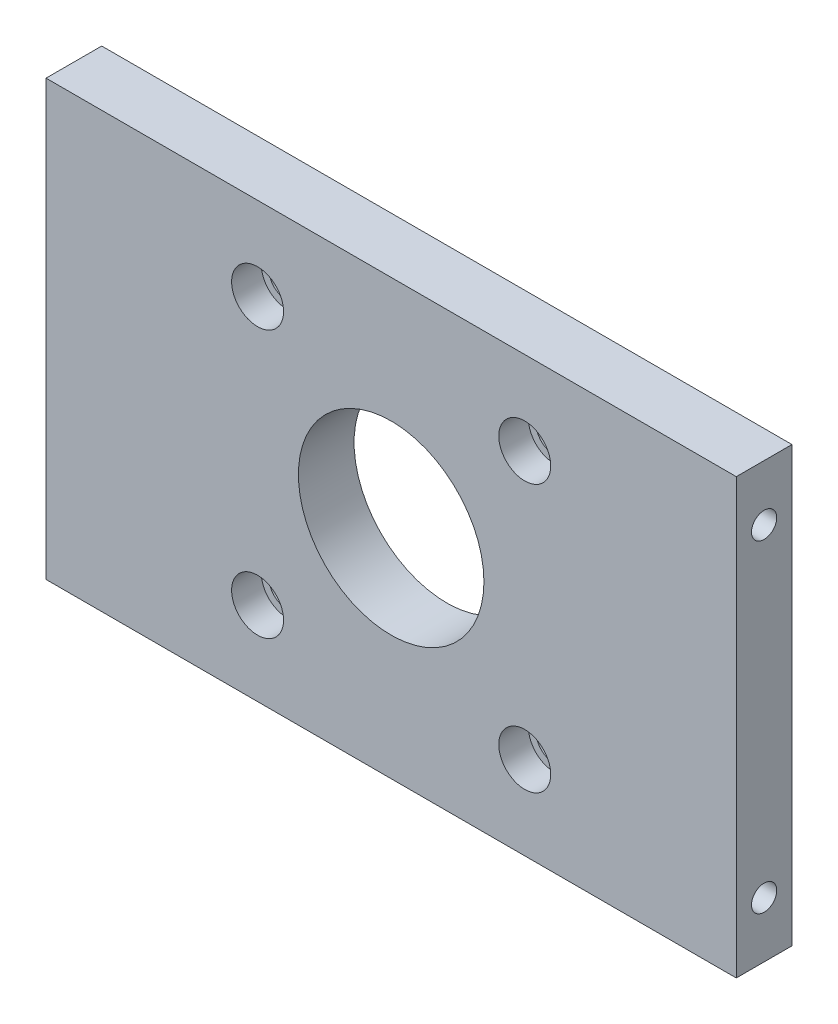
from build123d import *

# Parameters (mm, degrees)
ESQUISSE1_W                                     = 186
ESQUISSE1_H                                     = 117
BASE_EXTRUSION_DEPTH                            = 15
ESQUISSE2_R                                     = 25
ENL_V_MAT_EXTRU_1_DEPTH                         = 15
CHAMBRAGE_POUR_VIS_T_TE_CYLINDRIQUE_D           = 10
CHAMBRAGE_POUR_VIS_T_TE_CYLINDRIQUE_DEPTH       = 45
CHAMBRAGE_POUR_VIS_T_TE_CYLINDRIQUE_CBORE_D     = 14
CHAMBRAGE_POUR_VIS_T_TE_CYLINDRIQUE_CBORE_DEPTH = 8
CHAMBRAGE_POUR_VIS_T_TE_CYLINDRIQUE_TIP         = 3.004303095
TROU_TARAUD_M8X1_251_D                          = 6.8
TROU_TARAUD_M8X1_251_DEPTH                      = 46.25
TROU_TARAUD_M8X1_251_TIP                        = 2.042926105
TROU_TARAUD_M8X1_252_D                          = 6.8
TROU_TARAUD_M8X1_252_DEPTH                      = 46.25
TROU_TARAUD_M8X1_252_TIP                        = 2.042926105


with BuildPart() as part:
    # Esquisse1 → Base-Extrusion (new body)
    with BuildSketch(Plane.XY):
        with Locations((23.026869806, 5.193490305)):
            Rectangle(ESQUISSE1_W, ESQUISSE1_H)
    extrude(amount=BASE_EXTRUSION_DEPTH)

    # Esquisse2 → Enl_v. mat.-Extru.1 (cut)
    with BuildSketch(Plane.XY.offset(15)):
        with Locations((23.026869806, 5.193490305)):
            Circle(ESQUISSE2_R)
    extrude(amount=-ENL_V_MAT_EXTRU_1_DEPTH, mode=Mode.SUBTRACT)

    # Chambrage pour vis _ t_te cylindrique
    with Locations(Plane.XY.offset(15)):
        with Locations((-12.973130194, 41.193490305), (-12.973130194, -30.806509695), (59.026869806, -30.806509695), (59.026869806, 41.193490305)):
            CounterBoreHole(CHAMBRAGE_POUR_VIS_T_TE_CYLINDRIQUE_D / 2, CHAMBRAGE_POUR_VIS_T_TE_CYLINDRIQUE_CBORE_D / 2, CHAMBRAGE_POUR_VIS_T_TE_CYLINDRIQUE_CBORE_DEPTH, depth=CHAMBRAGE_POUR_VIS_T_TE_CYLINDRIQUE_DEPTH)
            with Locations((0, 0, -(CHAMBRAGE_POUR_VIS_T_TE_CYLINDRIQUE_DEPTH + CHAMBRAGE_POUR_VIS_T_TE_CYLINDRIQUE_TIP / 2))):  # 118° drill point
                Cone(0, CHAMBRAGE_POUR_VIS_T_TE_CYLINDRIQUE_D / 2, CHAMBRAGE_POUR_VIS_T_TE_CYLINDRIQUE_TIP, mode=Mode.SUBTRACT)

    # Trou taraud_ M8x1.251
    with Locations(Plane.ZY.offset(69.973130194)):
        with Locations((7.5, 48.693490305), (7.5, -38.306509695)):
            Hole(TROU_TARAUD_M8X1_251_D / 2, depth=TROU_TARAUD_M8X1_251_DEPTH)
            with Locations((0, 0, -(TROU_TARAUD_M8X1_251_DEPTH + TROU_TARAUD_M8X1_251_TIP / 2))):  # 118° drill point
                Cone(0, TROU_TARAUD_M8X1_251_D / 2, TROU_TARAUD_M8X1_251_TIP, mode=Mode.SUBTRACT)

    # Trou taraud_ M8x1.252
    with Locations(Plane(origin=(116.026869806, 0, 0), x_dir=(0, 0, -1), z_dir=(1, 0, 0))):
        with Locations((-7.5, 48.693490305), (-7.5, -38.306509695)):
            Hole(TROU_TARAUD_M8X1_252_D / 2, depth=TROU_TARAUD_M8X1_252_DEPTH)
            with Locations((0, 0, -(TROU_TARAUD_M8X1_252_DEPTH + TROU_TARAUD_M8X1_252_TIP / 2))):  # 118° drill point
                Cone(0, TROU_TARAUD_M8X1_252_D / 2, TROU_TARAUD_M8X1_252_TIP, mode=Mode.SUBTRACT)


solid = part.part
